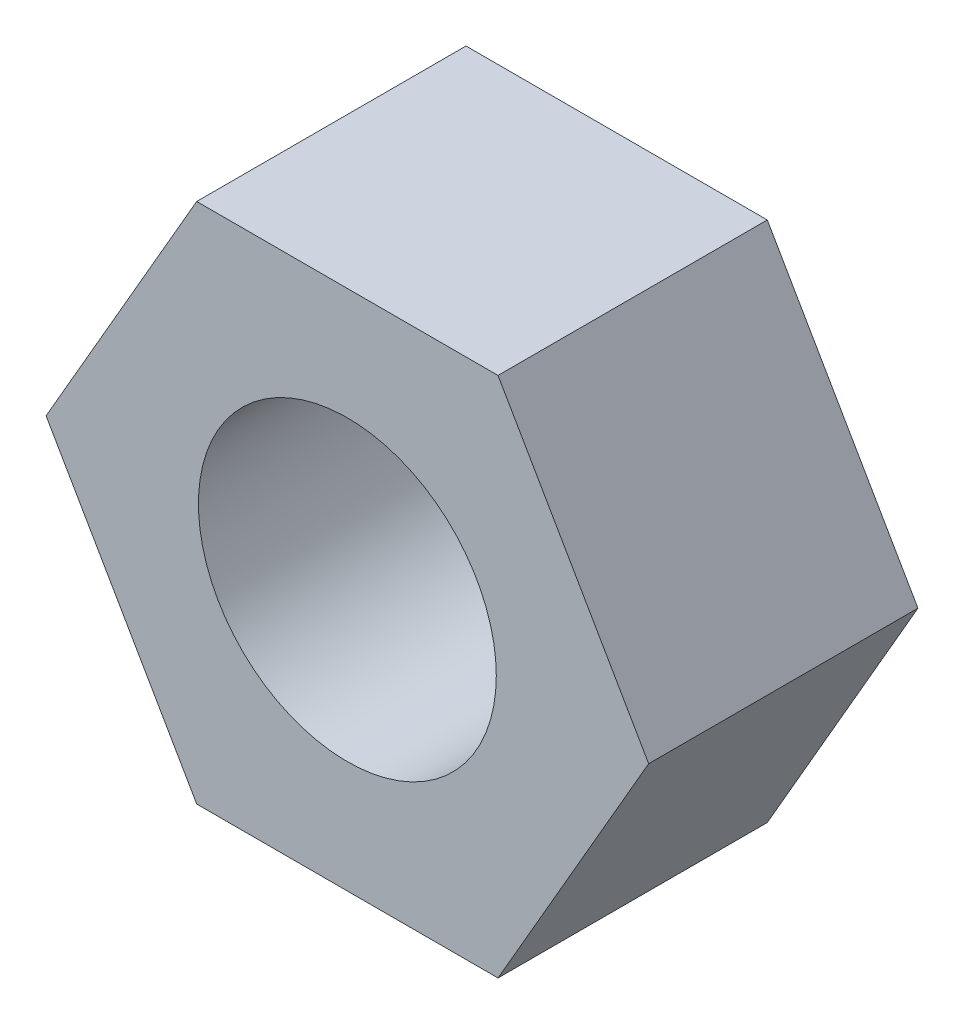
from build123d import *

# Parameters (mm, degrees)
EXTRUDE1_DEPTH     = 5.7404
SKETCH2_R          = 3.175
CUT_EXTRUDE1_DEPTH = 5.7404


with BuildPart() as part:
    # Sketch1 → Extrude1 (new body)
    with BuildSketch(Plane.XY):
        Polygon((3.211568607, -5.5626), (6.423137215, 0), (3.211568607, 5.5626), (-3.211568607, 5.5626), (-6.423137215, 0), (-3.211568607, -5.5626), align=None)
    extrude(amount=EXTRUDE1_DEPTH)

    # Sketch2 → Cut-Extrude1 (cut)
    with BuildSketch(Plane.XY.offset(5.7404)):
        Circle(SKETCH2_R)
    extrude(amount=-CUT_EXTRUDE1_DEPTH, mode=Mode.SUBTRACT)


solid = part.part
